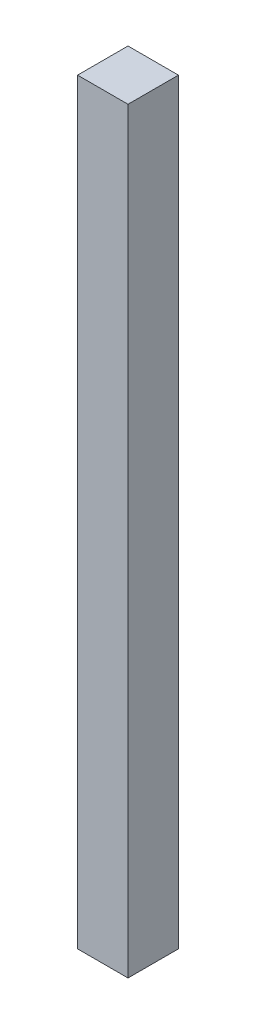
from build123d import *

# Parameters (mm, degrees)
SKETCH1_W           = 10
SKETCH1_H           = 10
BOSS_EXTRUDE1_DEPTH = 150


with BuildPart() as part:
    # Sketch1 → Boss-Extrude1 (new body)
    with BuildSketch(Plane(origin=(0, 0, 0), x_dir=(1, 0, 0), z_dir=(0, 1, 0))):
        with Locations((5, 5)):
            Rectangle(SKETCH1_W, SKETCH1_H)
    extrude(amount=-BOSS_EXTRUDE1_DEPTH)


solid = part.part
